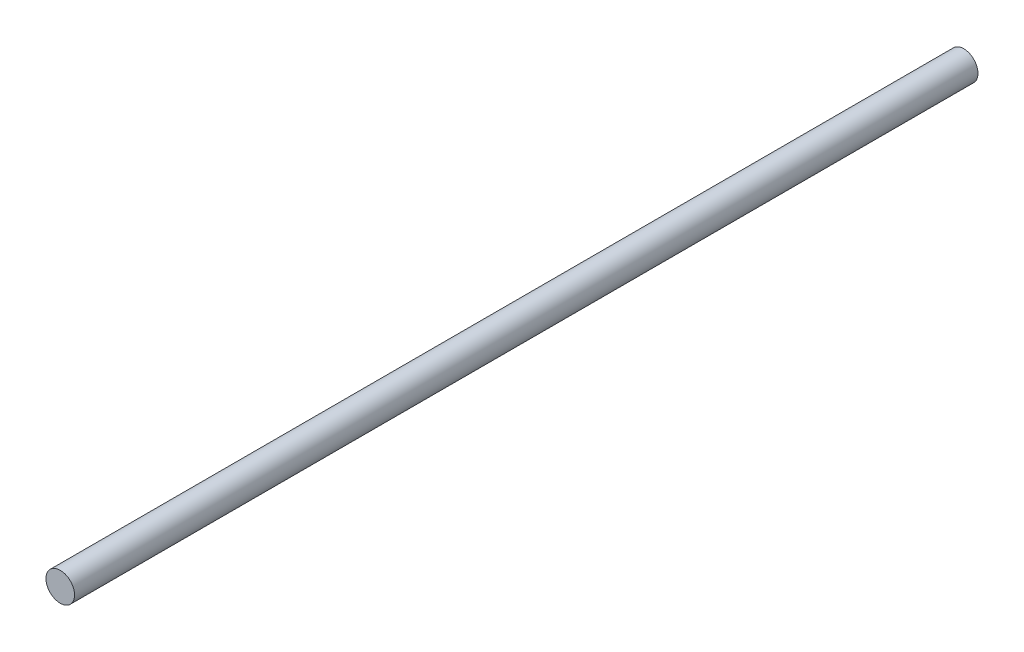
from build123d import *

# Parameters (mm, degrees)
SKETCH1_R           = 6.35
BOSS_EXTRUDE1_DEPTH = 401.574


with BuildPart() as part:
    # Sketch1 → Boss-Extrude1 (new body)
    with BuildSketch(Plane.XY):
        Circle(SKETCH1_R)
    extrude(amount=BOSS_EXTRUDE1_DEPTH)


solid = part.part
